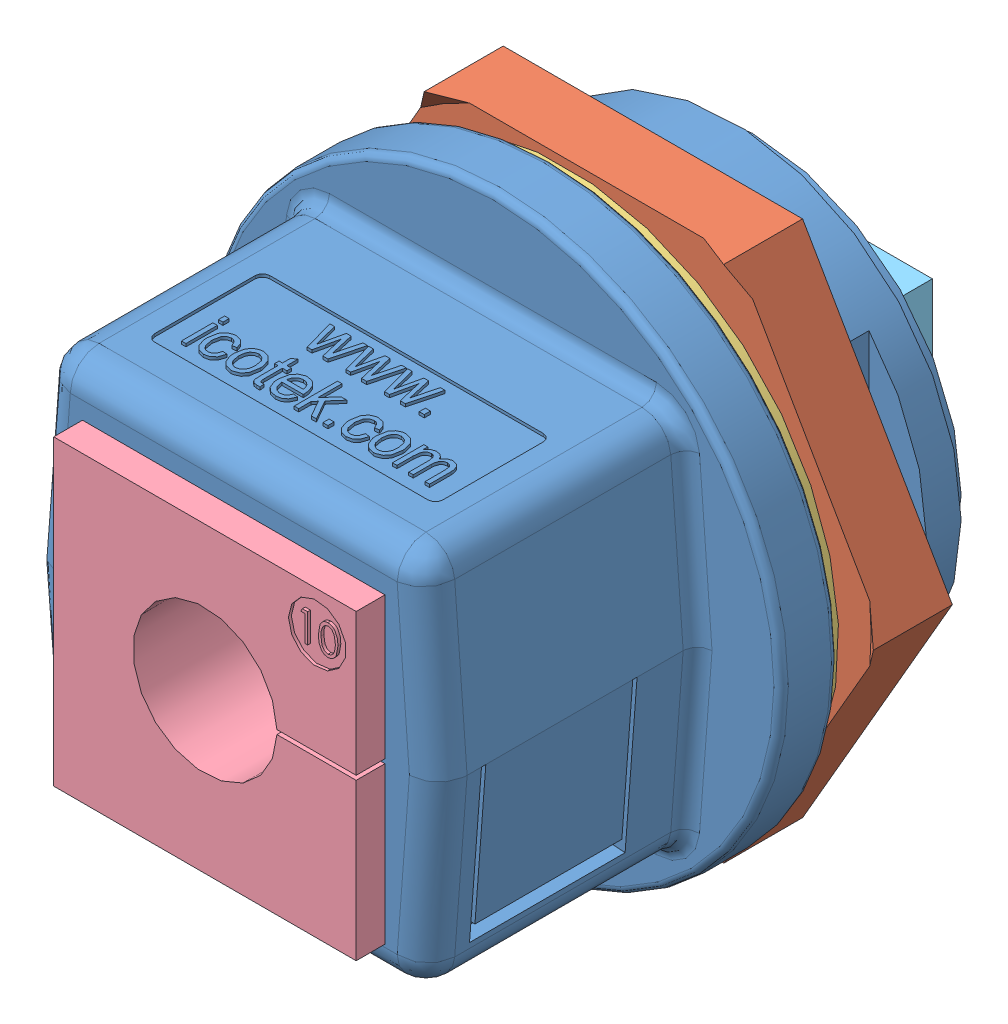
SolidWorks assembly 02-25-20-07-45-55_0_10450.SLDASM, configuration Default (file format 4100). Lengths in mm.
Overall size (43.31 40 40).
5 component instances, 5 part files, 0 mates.
Components (placement in the parent):
- 99431_01-1: 99431_01.SLDPRT [Default] at origin size (40 40 36)
- 99431_02-1: 99431_02.SLDPRT [Default] at origin size (43.31 39.01 5.49)
- 99431_03-1: 99431_03.SLDPRT [Default] at origin size (38 38 1)
- 99431_04-1: 99431_04.SLDPRT [Default] at origin size (21 21 19)
- 99431_05-1: 99431_05.SLDPRT [Default] at origin size (21 21 19)
